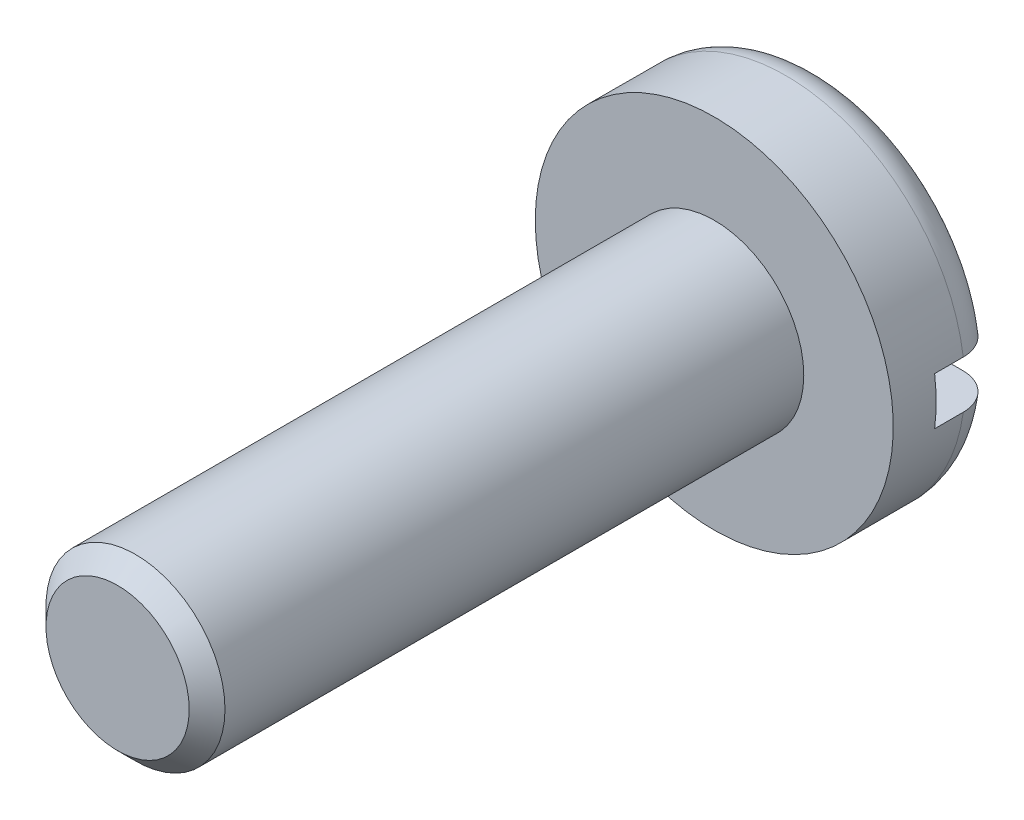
ISO-10303-21;
HEADER;
FILE_DESCRIPTION(('STEP AP214'),'2;1');
FILE_NAME('part.step','',(''),(''),'','','');
FILE_SCHEMA(('AUTOMOTIVE_DESIGN { 1 0 10303 214 1 1 1 1 }'));
ENDSEC;
DATA;
#1=APPLICATION_CONTEXT('core data for automotive mechanical design processes');
#2=APPLICATION_PROTOCOL_DEFINITION('international standard','automotive_design',2000,#1);
#3=PRODUCT_CONTEXT('',#1,'mechanical');
#4=PRODUCT('Part','Part','',(#3));
#5=PRODUCT_RELATED_PRODUCT_CATEGORY('part','',(#4));
#6=PRODUCT_DEFINITION_FORMATION('','',#4);
#7=PRODUCT_DEFINITION_CONTEXT('part definition',#1,'design');
#8=PRODUCT_DEFINITION('design','',#6,#7);
#9=PRODUCT_DEFINITION_SHAPE('','',#8);
#10=(LENGTH_UNIT() NAMED_UNIT(*) SI_UNIT(.MILLI.,.METRE.));
#11=(NAMED_UNIT(*) PLANE_ANGLE_UNIT() SI_UNIT($,.RADIAN.));
#12=(NAMED_UNIT(*) SI_UNIT($,.STERADIAN.) SOLID_ANGLE_UNIT());
#13=UNCERTAINTY_MEASURE_WITH_UNIT(LENGTH_MEASURE(1.E-05),#10,'distance_accuracy_value','');
#14=(GEOMETRIC_REPRESENTATION_CONTEXT(3) GLOBAL_UNCERTAINTY_ASSIGNED_CONTEXT((#13)) GLOBAL_UNIT_ASSIGNED_CONTEXT((#10,
#11,#12)) REPRESENTATION_CONTEXT('',''));
#15=CARTESIAN_POINT('',(0.,0.,0.));
#16=DIRECTION('',(0.,0.,1.));
#17=DIRECTION('',(1.,0.,0.));
#18=AXIS2_PLACEMENT_3D('',#15,#16,#17);
#19=CARTESIAN_POINT('',(0.,0.,-1.8));
#20=DIRECTION('',(0.,0.,1.));
#21=DIRECTION('',(1.,0.,0.));
#22=AXIS2_PLACEMENT_3D('',#19,#20,#21);
#23=PLANE('',#22);
#24=DIRECTION('',(1.,0.,0.));
#25=VECTOR('',#24,1.);
#26=CARTESIAN_POINT('',(-3.,-0.4,-1.8));
#27=LINE('',#26,#25);
#28=CARTESIAN_POINT('',(-2.36643191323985,-0.4,-1.8));
#29=VERTEX_POINT('',#28);
#30=CARTESIAN_POINT('',(2.36643191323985,-0.4,-1.8));
#31=VERTEX_POINT('',#30);
#32=EDGE_CURVE('E158',#29,#31,#27,.T.);
#33=ORIENTED_EDGE('',*,*,#32,.T.);
#34=CARTESIAN_POINT('',(0.,0.,-1.8));
#35=DIRECTION('',(0.,0.,-1.));
#36=DIRECTION('',(-1.,0.,0.));
#37=AXIS2_PLACEMENT_3D('',#34,#35,#36);
#38=CIRCLE('',#37,2.4);
#39=EDGE_CURVE('E110',#31,#29,#38,.T.);
#40=ORIENTED_EDGE('',*,*,#39,.T.);
#41=EDGE_LOOP('',(#33,#40));
#42=FACE_BOUND('',#41,.T.);
#43=ADVANCED_FACE('F29',(#42),#23,.F.);
#44=DIRECTION('',(-1.,0.,0.));
#45=VECTOR('',#44,1.);
#46=CARTESIAN_POINT('',(-3.,0.4,-1.8));
#47=LINE('',#46,#45);
#48=CARTESIAN_POINT('',(2.36643191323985,0.4,-1.8));
#49=VERTEX_POINT('',#48);
#50=CARTESIAN_POINT('',(-2.36643191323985,0.4,-1.8));
#51=VERTEX_POINT('',#50);
#52=EDGE_CURVE('E95',#49,#51,#47,.T.);
#53=ORIENTED_EDGE('',*,*,#52,.T.);
#54=EDGE_CURVE('E106',#51,#49,#38,.T.);
#55=ORIENTED_EDGE('',*,*,#54,.T.);
#56=EDGE_LOOP('',(#53,#55));
#57=FACE_BOUND('',#56,.T.);
#58=ADVANCED_FACE('F152',(#57),#23,.F.);
#59=CARTESIAN_POINT('',(0.,0.,-1.2));
#60=DIRECTION('',(0.,0.,-1.));
#61=DIRECTION('',(-1.,0.,0.));
#62=AXIS2_PLACEMENT_3D('',#59,#60,#61);
#63=TOROIDAL_SURFACE('',#62,2.4,0.6);
#64=CARTESIAN_POINT('',(-2.86791536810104,-0.4,-1.53809091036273));
#65=CARTESIAN_POINT('',(-2.88691562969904,-0.4,-1.51049908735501));
#66=CARTESIAN_POINT('',(-2.90360941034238,-0.4,-1.48129079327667));
#67=CARTESIAN_POINT('',(-2.93187395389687,-0.4,-1.42046435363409));
#68=CARTESIAN_POINT('',(-2.94343900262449,-0.4,-1.3888435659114));
#69=CARTESIAN_POINT('',(-2.9610841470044,-0.4,-1.32411273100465));
#70=CARTESIAN_POINT('',(-2.96716574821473,-0.4,-1.29100309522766));
#71=CARTESIAN_POINT('',(-2.973665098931,-0.4,-1.22424080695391));
#72=CARTESIAN_POINT('',(-2.97408418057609,-0.4,-1.19058828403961));
#73=CARTESIAN_POINT('',(-2.96925650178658,-0.4,-1.12377978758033));
#74=CARTESIAN_POINT('',(-2.96402436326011,-0.4,-1.09062275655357));
#75=CARTESIAN_POINT('',(-2.94807176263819,-0.4,-1.02565585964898));
#76=CARTESIAN_POINT('',(-2.93735113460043,-0.4,-0.993846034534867));
#77=CARTESIAN_POINT('',(-2.9107260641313,-0.4,-0.932444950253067));
#78=CARTESIAN_POINT('',(-2.89481734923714,-0.4,-0.902855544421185));
#79=CARTESIAN_POINT('',(-2.85828371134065,-0.4,-0.846748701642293));
#80=CARTESIAN_POINT('',(-2.83765870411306,-0.4,-0.820231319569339));
#81=CARTESIAN_POINT('',(-2.79216361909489,-0.4,-0.770859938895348));
#82=CARTESIAN_POINT('',(-2.76727091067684,-0.4,-0.748026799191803));
#83=CARTESIAN_POINT('',(-2.71403599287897,-0.4,-0.706818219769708));
#84=CARTESIAN_POINT('',(-2.68569364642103,-0.4,-0.68844295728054));
#85=CARTESIAN_POINT('',(-2.62608519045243,-0.4,-0.656485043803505));
#86=CARTESIAN_POINT('',(-2.59479436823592,-0.4,-0.642948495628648));
#87=CARTESIAN_POINT('',(-2.53040085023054,-0.4,-0.621255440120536));
#88=CARTESIAN_POINT('',(-2.49729804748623,-0.4,-0.613099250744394));
#89=CARTESIAN_POINT('',(-2.4298233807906,-0.4,-0.602302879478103));
#90=CARTESIAN_POINT('',(-2.39544144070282,-0.4,-0.599725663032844));
#91=CARTESIAN_POINT('',(-2.32672713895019,-0.4,-0.600320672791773));
#92=CARTESIAN_POINT('',(-2.29239478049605,-0.4,-0.603493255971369));
#93=CARTESIAN_POINT('',(-2.22440412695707,-0.4,-0.615543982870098));
#94=CARTESIAN_POINT('',(-2.19075551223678,-0.4,-0.624476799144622));
#95=CARTESIAN_POINT('',(-2.12542650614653,-0.4,-0.64784847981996));
#96=CARTESIAN_POINT('',(-2.09374619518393,-0.4,-0.662287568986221));
#97=CARTESIAN_POINT('',(-2.03317876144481,-0.4,-0.696326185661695));
#98=CARTESIAN_POINT('',(-2.00429919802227,-0.4,-0.715939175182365));
#99=CARTESIAN_POINT('',(-1.95028138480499,-0.4,-0.759778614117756));
#100=CARTESIAN_POINT('',(-1.92514302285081,-0.4,-0.784004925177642));
#101=CARTESIAN_POINT('',(-1.879604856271,-0.4,-0.836153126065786));
#102=CARTESIAN_POINT('',(-1.85916168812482,-0.4,-0.864037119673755));
#103=CARTESIAN_POINT('',(-1.82336424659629,-0.4,-0.922900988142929));
#104=CARTESIAN_POINT('',(-1.80800931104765,-0.4,-0.953880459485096));
#105=CARTESIAN_POINT('',(-1.783172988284,-0.4,-1.01736374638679));
#106=CARTESIAN_POINT('',(-1.77357543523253,-0.4,-1.04982210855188));
#107=CARTESIAN_POINT('',(-1.76008936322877,-0.4,-1.11590300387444));
#108=CARTESIAN_POINT('',(-1.75620005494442,-0.4,-1.14952537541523));
#109=CARTESIAN_POINT('',(-1.75428554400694,-0.4,-1.21627187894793));
#110=CARTESIAN_POINT('',(-1.75614646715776,-0.4,-1.24939279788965));
#111=CARTESIAN_POINT('',(-1.76542044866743,-0.4,-1.31484631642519));
#112=CARTESIAN_POINT('',(-1.77283334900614,-0.4,-1.34717893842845));
#113=CARTESIAN_POINT('',(-1.79293509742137,-0.4,-1.41006202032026));
#114=CARTESIAN_POINT('',(-1.80560987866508,-0.4,-1.4406169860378));
#115=CARTESIAN_POINT('',(-1.83582889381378,-0.4,-1.49921405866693));
#116=CARTESIAN_POINT('',(-1.85337349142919,-0.4,-1.52725597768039));
#117=CARTESIAN_POINT('',(-1.8931254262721,-0.4,-1.58053047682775));
#118=CARTESIAN_POINT('',(-1.91540419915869,-0.4,-1.6057097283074));
#119=CARTESIAN_POINT('',(-1.96379049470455,-0.4,-1.6520716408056));
#120=CARTESIAN_POINT('',(-1.98989845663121,-0.4,-1.67325384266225));
#121=CARTESIAN_POINT('',(-2.04582323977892,-0.4,-1.71150342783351));
#122=CARTESIAN_POINT('',(-2.07570903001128,-0.4,-1.72847001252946));
#123=CARTESIAN_POINT('',(-2.13787630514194,-0.4,-1.75722500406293));
#124=CARTESIAN_POINT('',(-2.17015799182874,-0.4,-1.76901297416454));
#125=CARTESIAN_POINT('',(-2.23668253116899,-0.4,-1.78721942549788));
#126=CARTESIAN_POINT('',(-2.27094628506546,-0.4,-1.79356164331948));
#127=CARTESIAN_POINT('',(-2.34005178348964,-0.4,-1.80041149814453));
#128=CARTESIAN_POINT('',(-2.37489351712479,-0.4,-1.80091924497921));
#129=CARTESIAN_POINT('',(-2.4442018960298,-0.4,-1.79606324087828));
#130=CARTESIAN_POINT('',(-2.47866813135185,-0.4,-1.79069361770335));
#131=CARTESIAN_POINT('',(-2.54620434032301,-0.4,-1.77419498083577));
#132=CARTESIAN_POINT('',(-2.57927401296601,-0.4,-1.76306473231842));
#133=CARTESIAN_POINT('',(-2.64279515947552,-0.4,-1.73544271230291));
#134=CARTESIAN_POINT('',(-2.67326439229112,-0.4,-1.71899173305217));
#135=CARTESIAN_POINT('',(-2.73093679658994,-0.4,-1.68116176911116));
#136=CARTESIAN_POINT('',(-2.75814405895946,-0.4,-1.65978905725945));
#137=CARTESIAN_POINT('',(-2.79912965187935,-0.4,-1.62148942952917));
#138=CARTESIAN_POINT('',(-2.81414187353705,-0.4,-1.60586063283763));
#139=CARTESIAN_POINT('',(-2.84239557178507,-0.4,-1.57307653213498));
#140=CARTESIAN_POINT('',(-2.85563706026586,-0.4,-1.5559212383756));
#141=CARTESIAN_POINT('',(-2.86791536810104,-0.4,-1.53809091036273));
#142=B_SPLINE_CURVE_WITH_KNOTS('',3,(#64,#65,#66,#67,#68,#69,#70,#71,#72,#73,#74,#75,#76,#77,
#78,#79,#80,#81,#82,#83,#84,#85,#86,#87,#88,#89,#90,#91,#92,#93,#94,#95,#96,#97,#98,#99,#100,
#101,#102,#103,#104,#105,#106,#107,#108,#109,#110,#111,#112,#113,#114,#115,#116,#117,#118,#119,
#120,#121,#122,#123,#124,#125,#126,#127,#128,#129,#130,#131,#132,#133,#134,#135,#136,#137,#138,
#139,#140,#141),.UNSPECIFIED.,.T.,.F.,(4,2,2,2,2,2,2,2,2,2,2,2,2,2,2,2,2,2,2,2,2,2,2,2,2,2,2,2,
2,2,2,2,2,2,2,2,2,2,4),(0.,0.100424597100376,0.200960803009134,0.301469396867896,
0.401954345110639,0.502179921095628,0.602408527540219,0.702719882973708,0.803033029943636,
0.903895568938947,1.00476211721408,1.10656558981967,1.20837507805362,1.31132774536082,
1.4142868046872,1.51823776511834,1.6221929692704,1.72642136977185,1.83064664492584,
1.933866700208,2.03707331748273,2.13812063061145,2.23915396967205,2.33819941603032,
2.43724204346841,2.53602158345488,2.63480850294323,2.73520792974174,2.8356188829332,
2.93823928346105,3.04086833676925,3.14491222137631,3.24895414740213,3.3531001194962,
3.45726842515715,3.56065632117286,3.66391316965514,3.72880977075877,3.79370593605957),.UNSPECIFIED.);
#143=CARTESIAN_POINT('',(-2.9732137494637,-0.4,-1.2));
#144=VERTEX_POINT('',#143);
#145=EDGE_CURVE('E50',#29,#144,#142,.T.);
#146=ORIENTED_EDGE('',*,*,#145,.F.);
#147=ORIENTED_EDGE('',*,*,#39,.F.);
#148=CARTESIAN_POINT('',(1.80821051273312,-0.4,-1.44415878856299));
#149=CARTESIAN_POINT('',(1.79450723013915,-0.4,-1.41412104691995));
#150=CARTESIAN_POINT('',(1.783303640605,-0.4,-1.38291945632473));
#151=CARTESIAN_POINT('',(1.7662786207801,-0.4,-1.31905688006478));
#152=CARTESIAN_POINT('',(1.76046230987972,-0.4,-1.28639453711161));
#153=CARTESIAN_POINT('',(1.75442120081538,-0.4,-1.22055541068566));
#154=CARTESIAN_POINT('',(1.75419603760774,-0.4,-1.1873786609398));
#155=CARTESIAN_POINT('',(1.75934539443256,-0.4,-1.12147069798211));
#156=CARTESIAN_POINT('',(1.76471879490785,-0.4,-1.08873939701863));
#157=CARTESIAN_POINT('',(1.78084975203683,-0.4,-1.02476479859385));
#158=CARTESIAN_POINT('',(1.79158706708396,-0.4,-0.993516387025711));
#159=CARTESIAN_POINT('',(1.81808721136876,-0.4,-0.933229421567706));
#160=CARTESIAN_POINT('',(1.83385049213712,-0.4,-0.904191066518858));
#161=CARTESIAN_POINT('',(1.87016113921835,-0.4,-0.848717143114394));
#162=CARTESIAN_POINT('',(1.89077014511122,-0.4,-0.822321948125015));
#163=CARTESIAN_POINT('',(1.93603826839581,-0.4,-0.773270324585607));
#164=CARTESIAN_POINT('',(1.96069783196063,-0.4,-0.750614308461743));
#165=CARTESIAN_POINT('',(2.0139571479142,-0.4,-0.709156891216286));
#166=CARTESIAN_POINT('',(2.04263221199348,-0.4,-0.690452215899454));
#167=CARTESIAN_POINT('',(2.10267683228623,-0.4,-0.658032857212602));
#168=CARTESIAN_POINT('',(2.13404663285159,-0.4,-0.644318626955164));
#169=CARTESIAN_POINT('',(2.19913303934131,-0.4,-0.622064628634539));
#170=CARTESIAN_POINT('',(2.23287910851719,-0.4,-0.613610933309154));
#171=CARTESIAN_POINT('',(2.30131074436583,-0.4,-0.602466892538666));
#172=CARTESIAN_POINT('',(2.33599634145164,-0.4,-0.599776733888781));
#173=CARTESIAN_POINT('',(2.40544538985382,-0.4,-0.600253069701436));
#174=CARTESIAN_POINT('',(2.44020871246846,-0.4,-0.603439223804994));
#175=CARTESIAN_POINT('',(2.50869729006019,-0.4,-0.615642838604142));
#176=CARTESIAN_POINT('',(2.54242257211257,-0.4,-0.624660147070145));
#177=CARTESIAN_POINT('',(2.60763064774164,-0.4,-0.648217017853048));
#178=CARTESIAN_POINT('',(2.63912698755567,-0.4,-0.662719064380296));
#179=CARTESIAN_POINT('',(2.69919951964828,-0.4,-0.696862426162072));
#180=CARTESIAN_POINT('',(2.72777587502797,-0.4,-0.716503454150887));
#181=CARTESIAN_POINT('',(2.78085904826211,-0.4,-0.760134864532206));
#182=CARTESIAN_POINT('',(2.80540738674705,-0.4,-0.784074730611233));
#183=CARTESIAN_POINT('',(2.85008327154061,-0.4,-0.835775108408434));
#184=CARTESIAN_POINT('',(2.8702110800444,-0.4,-0.863535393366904));
#185=CARTESIAN_POINT('',(2.90525154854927,-0.4,-0.921768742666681));
#186=CARTESIAN_POINT('',(2.92021748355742,-0.4,-0.952209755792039));
#187=CARTESIAN_POINT('',(2.94478217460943,-0.4,-1.01518535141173));
#188=CARTESIAN_POINT('',(2.95438117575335,-0.4,-1.04771983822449));
#189=CARTESIAN_POINT('',(2.9678730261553,-0.4,-1.1136969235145));
#190=CARTESIAN_POINT('',(2.97180801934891,-0.4,-1.14713090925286));
#191=CARTESIAN_POINT('',(2.97399012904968,-0.4,-1.21418363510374));
#192=CARTESIAN_POINT('',(2.97223738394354,-0.4,-1.2478023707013));
#193=CARTESIAN_POINT('',(2.96311046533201,-0.4,-1.31416285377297));
#194=CARTESIAN_POINT('',(2.95575341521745,-0.4,-1.3469069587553));
#195=CARTESIAN_POINT('',(2.93565569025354,-0.4,-1.41069837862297));
#196=CARTESIAN_POINT('',(2.92291501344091,-0.4,-1.44174569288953));
#197=CARTESIAN_POINT('',(2.89239690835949,-0.4,-1.50132550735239));
#198=CARTESIAN_POINT('',(2.87461067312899,-0.4,-1.52985349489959));
#199=CARTESIAN_POINT('',(2.83452923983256,-0.4,-1.58354220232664));
#200=CARTESIAN_POINT('',(2.81223393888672,-0.4,-1.6087028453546));
#201=CARTESIAN_POINT('',(2.76362299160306,-0.4,-1.65511787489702));
#202=CARTESIAN_POINT('',(2.73728293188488,-0.4,-1.67634668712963));
#203=CARTESIAN_POINT('',(2.68144180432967,-0.4,-1.71413135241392));
#204=CARTESIAN_POINT('',(2.65194058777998,-0.4,-1.73068698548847));
#205=CARTESIAN_POINT('',(2.59030619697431,-0.4,-1.75883285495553));
#206=CARTESIAN_POINT('',(2.55814997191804,-0.4,-1.77037260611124));
#207=CARTESIAN_POINT('',(2.4923689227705,-0.4,-1.78795653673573));
#208=CARTESIAN_POINT('',(2.45874400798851,-0.4,-1.79400037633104));
#209=CARTESIAN_POINT('',(2.39057532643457,-0.4,-1.80048954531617));
#210=CARTESIAN_POINT('',(2.35602547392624,-0.4,-1.80087097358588));
#211=CARTESIAN_POINT('',(2.2873444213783,-0.4,-1.7958819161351));
#212=CARTESIAN_POINT('',(2.25321323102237,-0.4,-1.79051129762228));
#213=CARTESIAN_POINT('',(2.18602611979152,-0.4,-1.774105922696));
#214=CARTESIAN_POINT('',(2.15298206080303,-0.4,-1.76302254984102));
#215=CARTESIAN_POINT('',(2.08921057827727,-0.4,-1.73546663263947));
#216=CARTESIAN_POINT('',(2.05848379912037,-0.4,-1.71899259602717));
#217=CARTESIAN_POINT('',(2.00021398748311,-0.4,-1.68108334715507));
#218=CARTESIAN_POINT('',(1.97267445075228,-0.4,-1.65964276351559));
#219=CARTESIAN_POINT('',(1.9216665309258,-0.4,-1.61240514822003));
#220=CARTESIAN_POINT('',(1.89819309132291,-0.4,-1.58661360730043));
#221=CARTESIAN_POINT('',(1.86353882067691,-0.4,-1.54123382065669));
#222=CARTESIAN_POINT('',(1.85095456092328,-0.4,-1.52269988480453));
#223=CARTESIAN_POINT('',(1.82793428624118,-0.4,-1.48434176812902));
#224=CARTESIAN_POINT('',(1.81749824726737,-0.4,-1.46451760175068));
#225=CARTESIAN_POINT('',(1.80821051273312,-0.4,-1.44415878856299));
#226=B_SPLINE_CURVE_WITH_KNOTS('',3,(#148,#149,#150,#151,#152,#153,#154,#155,#156,#157,#158,
#159,#160,#161,#162,#163,#164,#165,#166,#167,#168,#169,#170,#171,#172,#173,#174,#175,#176,#177,
#178,#179,#180,#181,#182,#183,#184,#185,#186,#187,#188,#189,#190,#191,#192,#193,#194,#195,#196,
#197,#198,#199,#200,#201,#202,#203,#204,#205,#206,#207,#208,#209,#210,#211,#212,#213,#214,#215,
#216,#217,#218,#219,#220,#221,#222,#223,#224,#225),.UNSPECIFIED.,.T.,.F.,(4,2,2,2,2,2,2,2,2,2,2,
2,2,2,2,2,2,2,2,2,2,2,2,2,2,2,2,2,2,2,2,2,2,2,2,2,2,2,4),(0.,0.0989673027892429,
0.198028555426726,0.297083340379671,0.396118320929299,0.494782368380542,0.593455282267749,
0.693458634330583,0.793473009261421,0.895707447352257,0.997951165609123,1.10182660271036,
1.20570540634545,1.30993237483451,1.41415662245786,1.51768050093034,1.6211985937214,
1.72357156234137,1.82593845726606,1.92721478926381,2.02848649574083,2.12900070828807,
2.22951247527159,2.32971836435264,2.42992428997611,2.53030621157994,2.63069042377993,
2.73170625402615,2.83272683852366,2.93474189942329,3.03676326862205,3.13993509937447,
3.2431093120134,3.34717641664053,3.45127235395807,3.55548140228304,3.65955991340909,
3.72663817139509,3.79371567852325),.UNSPECIFIED.);
#227=CARTESIAN_POINT('',(2.9732137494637,-0.4,-1.2));
#228=VERTEX_POINT('',#227);
#229=EDGE_CURVE('E122',#228,#31,#226,.T.);
#230=ORIENTED_EDGE('',*,*,#229,.F.);
#231=CARTESIAN_POINT('',(0.,0.,-1.2));
#232=DIRECTION('',(0.,0.,-1.));
#233=DIRECTION('',(-1.,0.,0.));
#234=AXIS2_PLACEMENT_3D('',#231,#232,#233);
#235=CIRCLE('',#234,3.);
#236=EDGE_CURVE('E117',#228,#144,#235,.T.);
#237=ORIENTED_EDGE('',*,*,#236,.T.);
#238=EDGE_LOOP('',(#146,#147,#230,#237));
#239=FACE_BOUND('',#238,.T.);
#240=ADVANCED_FACE('F130',(#239),#63,.T.);
#241=CARTESIAN_POINT('',(-2.86791536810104,0.4,-1.53809091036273));
#242=CARTESIAN_POINT('',(-2.84868400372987,0.4,-1.56601293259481));
#243=CARTESIAN_POINT('',(-2.82706189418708,0.4,-1.59232017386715));
#244=CARTESIAN_POINT('',(-2.77967761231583,0.4,-1.64094009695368));
#245=CARTESIAN_POINT('',(-2.75391006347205,0.4,-1.66324751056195));
#246=CARTESIAN_POINT('',(-2.6990251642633,0.4,-1.70321130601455));
#247=CARTESIAN_POINT('',(-2.66991093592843,0.4,-1.72087197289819));
#248=CARTESIAN_POINT('',(-2.60915830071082,0.4,-1.7510936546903));
#249=CARTESIAN_POINT('',(-2.57752051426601,0.4,-1.76365591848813));
#250=CARTESIAN_POINT('',(-2.51233990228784,0.4,-1.78344987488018));
#251=CARTESIAN_POINT('',(-2.47878374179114,0.4,-1.79063764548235));
#252=CARTESIAN_POINT('',(-2.41094258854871,0.4,-1.79934399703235));
#253=CARTESIAN_POINT('',(-2.37665752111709,0.4,-1.80086199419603));
#254=CARTESIAN_POINT('',(-2.30793726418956,0.4,-1.79819413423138));
#255=CARTESIAN_POINT('',(-2.27350447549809,0.4,-1.7939462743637));
#256=CARTESIAN_POINT('',(-2.20582843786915,0.4,-1.77976818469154));
#257=CARTESIAN_POINT('',(-2.17258525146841,0.4,-1.76983765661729));
#258=CARTESIAN_POINT('',(-2.10802002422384,0.4,-1.7444896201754));
#259=CARTESIAN_POINT('',(-2.07671123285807,0.4,-1.7290383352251));
#260=CARTESIAN_POINT('',(-2.01714433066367,0.4,-1.6930784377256));
#261=CARTESIAN_POINT('',(-1.98888623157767,0.4,-1.67256980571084));
#262=CARTESIAN_POINT('',(-1.93637236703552,0.4,-1.62714599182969));
#263=CARTESIAN_POINT('',(-1.91210023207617,0.4,-1.6022497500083));
#264=CARTESIAN_POINT('',(-1.86816721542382,0.4,-1.5486737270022));
#265=CARTESIAN_POINT('',(-1.84850591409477,0.4,-1.51999429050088));
#266=CARTESIAN_POINT('',(-1.8147314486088,0.4,-1.46018356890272));
#267=CARTESIAN_POINT('',(-1.80052886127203,0.4,-1.42910280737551));
#268=CARTESIAN_POINT('',(-1.77767972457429,0.4,-1.36496231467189));
#269=CARTESIAN_POINT('',(-1.76903232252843,0.4,-1.33190288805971));
#270=CARTESIAN_POINT('',(-1.75772456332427,0.4,-1.26553575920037));
#271=CARTESIAN_POINT('',(-1.75493497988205,0.4,-1.23225003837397));
#272=CARTESIAN_POINT('',(-1.75505258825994,0.4,-1.16569015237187));
#273=CARTESIAN_POINT('',(-1.75795932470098,0.4,-1.13241598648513));
#274=CARTESIAN_POINT('',(-1.76930492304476,0.4,-1.06720273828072));
#275=CARTESIAN_POINT('',(-1.77768298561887,0.4,-1.03525304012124));
#276=CARTESIAN_POINT('',(-1.79963421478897,0.4,-0.97319290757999));
#277=CARTESIAN_POINT('',(-1.81320758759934,0.4,-0.943082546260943));
#278=CARTESIAN_POINT('',(-1.84527443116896,0.4,-0.885231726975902));
#279=CARTESIAN_POINT('',(-1.86381370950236,0.4,-0.857516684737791));
#280=CARTESIAN_POINT('',(-1.90518919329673,0.4,-0.805506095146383));
#281=CARTESIAN_POINT('',(-1.92802585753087,0.4,-0.781210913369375));
#282=CARTESIAN_POINT('',(-1.97787851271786,0.4,-0.73617072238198));
#283=CARTESIAN_POINT('',(-2.0049744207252,0.4,-0.715514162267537));
#284=CARTESIAN_POINT('',(-2.06219809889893,0.4,-0.678945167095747));
#285=CARTESIAN_POINT('',(-2.09232617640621,0.4,-0.663033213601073));
#286=CARTESIAN_POINT('',(-2.15535638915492,0.4,-0.636120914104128));
#287=CARTESIAN_POINT('',(-2.18829916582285,0.4,-0.625215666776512));
#288=CARTESIAN_POINT('',(-2.25554284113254,0.4,-0.609051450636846));
#289=CARTESIAN_POINT('',(-2.28984380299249,0.4,-0.603792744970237));
#290=CARTESIAN_POINT('',(-2.3590569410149,0.4,-0.599065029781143));
#291=CARTESIAN_POINT('',(-2.39397158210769,0.4,-0.599631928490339));
#292=CARTESIAN_POINT('',(-2.46320550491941,0.4,-0.606649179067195));
#293=CARTESIAN_POINT('',(-2.49752479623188,0.4,-0.613099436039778));
#294=CARTESIAN_POINT('',(-2.56440715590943,0.4,-0.631681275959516));
#295=CARTESIAN_POINT('',(-2.59697808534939,0.4,-0.643784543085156));
#296=CARTESIAN_POINT('',(-2.65959335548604,0.4,-0.673344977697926));
#297=CARTESIAN_POINT('',(-2.68963782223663,0.4,-0.690801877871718));
#298=CARTESIAN_POINT('',(-2.7460058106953,0.4,-0.730378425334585));
#299=CARTESIAN_POINT('',(-2.77236533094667,0.4,-0.752446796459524));
#300=CARTESIAN_POINT('',(-2.82095331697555,0.4,-0.800740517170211));
#301=CARTESIAN_POINT('',(-2.8431820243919,0.4,-0.826965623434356));
#302=CARTESIAN_POINT('',(-2.88262005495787,0.4,-0.882515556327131));
#303=CARTESIAN_POINT('',(-2.89988204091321,0.4,-0.9118029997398));
#304=CARTESIAN_POINT('',(-2.92919534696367,0.4,-0.972877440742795));
#305=CARTESIAN_POINT('',(-2.94124713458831,0.4,-1.00466421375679));
#306=CARTESIAN_POINT('',(-2.95970040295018,0.4,-1.06954657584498));
#307=CARTESIAN_POINT('',(-2.96614872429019,0.4,-1.10262885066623));
#308=CARTESIAN_POINT('',(-2.97337569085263,0.4,-1.1694160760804));
#309=CARTESIAN_POINT('',(-2.97415305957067,0.4,-1.20312116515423));
#310=CARTESIAN_POINT('',(-2.97002108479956,0.4,-1.27005512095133));
#311=CARTESIAN_POINT('',(-2.96513219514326,0.4,-1.30328526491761));
#312=CARTESIAN_POINT('',(-2.9498475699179,0.4,-1.36842386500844));
#313=CARTESIAN_POINT('',(-2.93945864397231,0.4,-1.40033390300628));
#314=CARTESIAN_POINT('',(-2.91857987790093,0.4,-1.44989721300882));
#315=CARTESIAN_POINT('',(-2.9097136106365,0.4,-1.46825183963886));
#316=CARTESIAN_POINT('',(-2.89015758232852,0.4,-1.50396217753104));
#317=CARTESIAN_POINT('',(-2.8794678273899,0.4,-1.52131789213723));
#318=CARTESIAN_POINT('',(-2.86791536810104,0.4,-1.53809091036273));
#319=B_SPLINE_CURVE_WITH_KNOTS('',3,(#241,#242,#243,#244,#245,#246,#247,#248,#249,#250,#251,
#252,#253,#254,#255,#256,#257,#258,#259,#260,#261,#262,#263,#264,#265,#266,#267,#268,#269,#270,
#271,#272,#273,#274,#275,#276,#277,#278,#279,#280,#281,#282,#283,#284,#285,#286,#287,#288,#289,
#290,#291,#292,#293,#294,#295,#296,#297,#298,#299,#300,#301,#302,#303,#304,#305,#306,#307,#308,
#309,#310,#311,#312,#313,#314,#315,#316,#317,#318),.UNSPECIFIED.,.T.,.F.,(4,2,2,2,2,2,2,2,2,2,2,
2,2,2,2,2,2,2,2,2,2,2,2,2,2,2,2,2,2,2,2,2,2,2,2,2,2,2,4),(0.,0.101636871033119,
0.203406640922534,0.305082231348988,0.40673290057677,0.509205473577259,0.611688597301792,
0.715282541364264,0.818881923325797,0.923126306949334,1.02737109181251,1.13117643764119,
1.23497233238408,1.3369869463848,1.43898589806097,1.53870999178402,1.63842611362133,
1.73705258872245,1.83568297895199,1.93525652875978,2.03484071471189,2.13658522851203,
2.23834006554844,2.34195493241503,2.44557462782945,2.54983340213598,2.65409049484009,
2.75783087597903,2.86156607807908,2.96420396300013,3.06683584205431,3.16833561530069,
3.26982627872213,3.37046016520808,3.47111670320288,3.57141102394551,3.67158145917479,
3.73263587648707,3.79369008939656),.UNSPECIFIED.);
#320=CARTESIAN_POINT('',(-2.9732137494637,0.4,-1.2));
#321=VERTEX_POINT('',#320);
#322=EDGE_CURVE('E163',#321,#51,#319,.T.);
#323=ORIENTED_EDGE('',*,*,#322,.F.);
#324=CARTESIAN_POINT('',(2.9732137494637,0.4,-1.2));
#325=VERTEX_POINT('',#324);
#326=EDGE_CURVE('E115',#321,#325,#235,.T.);
#327=ORIENTED_EDGE('',*,*,#326,.T.);
#328=CARTESIAN_POINT('',(1.80821051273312,0.4,-1.44415878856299));
#329=CARTESIAN_POINT('',(1.82231047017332,0.4,-1.47505857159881));
#330=CARTESIAN_POINT('',(1.83907724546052,0.4,-1.50477209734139));
#331=CARTESIAN_POINT('',(1.87740165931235,0.4,-1.56096909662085));
#332=CARTESIAN_POINT('',(1.89896631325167,0.4,-1.5874477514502));
#333=CARTESIAN_POINT('',(1.94618177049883,0.4,-1.63639884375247));
#334=CARTESIAN_POINT('',(1.97182686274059,0.4,-1.65887678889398));
#335=CARTESIAN_POINT('',(2.02646954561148,0.4,-1.69927713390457));
#336=CARTESIAN_POINT('',(2.05546627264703,0.4,-1.7172007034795));
#337=CARTESIAN_POINT('',(2.11645988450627,0.4,-1.7482694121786));
#338=CARTESIAN_POINT('',(2.14849486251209,0.4,-1.76133979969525));
#339=CARTESIAN_POINT('',(2.21429462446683,0.4,-1.78197209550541));
#340=CARTESIAN_POINT('',(2.24805958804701,0.4,-1.78953343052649));
#341=CARTESIAN_POINT('',(2.31668083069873,0.4,-1.79897312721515));
#342=CARTESIAN_POINT('',(2.35154411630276,0.4,-1.8008006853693));
#343=CARTESIAN_POINT('',(2.4210815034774,0.4,-1.79855854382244));
#344=CARTESIAN_POINT('',(2.45575560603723,0.4,-1.79448887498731));
#345=CARTESIAN_POINT('',(2.52381156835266,0.4,-1.78056283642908));
#346=CARTESIAN_POINT('',(2.557197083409,0.4,-1.77072435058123));
#347=CARTESIAN_POINT('',(2.62181601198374,0.4,-1.74552630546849));
#348=CARTESIAN_POINT('',(2.65304953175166,0.4,-1.7301670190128));
#349=CARTESIAN_POINT('',(2.7121444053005,0.4,-1.69452205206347));
#350=CARTESIAN_POINT('',(2.74003609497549,0.4,-1.67428667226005));
#351=CARTESIAN_POINT('',(2.79197658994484,0.4,-1.62937109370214));
#352=CARTESIAN_POINT('',(2.81602562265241,0.4,-1.60469115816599));
#353=CARTESIAN_POINT('',(2.85931177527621,0.4,-1.55188767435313));
#354=CARTESIAN_POINT('',(2.87860010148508,0.4,-1.5238060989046));
#355=CARTESIAN_POINT('',(2.91213782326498,0.4,-1.46477974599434));
#356=CARTESIAN_POINT('',(2.92638748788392,0.4,-1.43383512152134));
#357=CARTESIAN_POINT('',(2.94931443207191,0.4,-1.37026360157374));
#358=CARTESIAN_POINT('',(2.95804100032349,0.4,-1.33765447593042));
#359=CARTESIAN_POINT('',(2.9698648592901,0.4,-1.27143133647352));
#360=CARTESIAN_POINT('',(2.97296233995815,0.4,-1.23781735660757));
#361=CARTESIAN_POINT('',(2.97343453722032,0.4,-1.17071861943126));
#362=CARTESIAN_POINT('',(2.97083788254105,0.4,-1.1372340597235));
#363=CARTESIAN_POINT('',(2.96005758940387,0.4,-1.07117725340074));
#364=CARTESIAN_POINT('',(2.95187400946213,0.4,-1.0386049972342));
#365=CARTESIAN_POINT('',(2.93016485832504,0.4,-0.975303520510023));
#366=CARTESIAN_POINT('',(2.91664082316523,0.4,-0.944573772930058));
#367=CARTESIAN_POINT('',(2.88464744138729,0.4,-0.885807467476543));
#368=CARTESIAN_POINT('',(2.86617802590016,0.4,-0.857770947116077));
#369=CARTESIAN_POINT('',(2.82473788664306,0.4,-0.80504812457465));
#370=CARTESIAN_POINT('',(2.80174756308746,0.4,-0.780377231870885));
#371=CARTESIAN_POINT('',(2.75198245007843,0.4,-0.735206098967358));
#372=CARTESIAN_POINT('',(2.7252075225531,0.4,-0.714706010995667));
#373=CARTESIAN_POINT('',(2.66839302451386,0.4,-0.678266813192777));
#374=CARTESIAN_POINT('',(2.638327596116,0.4,-0.662368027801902));
#375=CARTESIAN_POINT('',(2.57597556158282,0.4,-0.635781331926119));
#376=CARTESIAN_POINT('',(2.54368883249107,0.4,-0.625093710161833));
#377=CARTESIAN_POINT('',(2.47743101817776,0.4,-0.609107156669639));
#378=CARTESIAN_POINT('',(2.44344529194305,0.4,-0.603868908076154));
#379=CARTESIAN_POINT('',(2.37507589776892,0.4,-0.599108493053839));
#380=CARTESIAN_POINT('',(2.34069220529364,0.4,-0.599586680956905));
#381=CARTESIAN_POINT('',(2.27212156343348,0.4,-0.606261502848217));
#382=CARTESIAN_POINT('',(2.23794040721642,0.4,-0.612517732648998));
#383=CARTESIAN_POINT('',(2.17110155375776,0.4,-0.630650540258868));
#384=CARTESIAN_POINT('',(2.13844393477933,0.4,-0.642527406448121));
#385=CARTESIAN_POINT('',(2.07542270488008,0.4,-0.671647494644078));
#386=CARTESIAN_POINT('',(2.04507089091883,0.4,-0.688916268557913));
#387=CARTESIAN_POINT('',(1.987719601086,0.4,-0.728335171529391));
#388=CARTESIAN_POINT('',(1.96072010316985,0.4,-0.750485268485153));
#389=CARTESIAN_POINT('',(1.91105063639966,0.4,-0.798907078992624));
#390=CARTESIAN_POINT('',(1.88835375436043,0.4,-0.825151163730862));
#391=CARTESIAN_POINT('',(1.84779009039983,0.4,-0.881138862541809));
#392=CARTESIAN_POINT('',(1.82992258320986,0.4,-0.910881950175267));
#393=CARTESIAN_POINT('',(1.79990105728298,0.4,-0.972422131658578));
#394=CARTESIAN_POINT('',(1.78764449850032,0.4,-1.0041691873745));
#395=CARTESIAN_POINT('',(1.76876607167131,0.4,-1.06930591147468));
#396=CARTESIAN_POINT('',(1.76214482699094,0.4,-1.10269576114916));
#397=CARTESIAN_POINT('',(1.75485143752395,0.4,-1.16940159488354));
#398=CARTESIAN_POINT('',(1.7540568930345,0.4,-1.20270431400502));
#399=CARTESIAN_POINT('',(1.75812388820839,0.4,-1.2689325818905));
#400=CARTESIAN_POINT('',(1.76297799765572,0.4,-1.30185856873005));
#401=CARTESIAN_POINT('',(1.77500398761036,0.4,-1.35302191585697));
#402=CARTESIAN_POINT('',(1.78038529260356,0.4,-1.37169888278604));
#403=CARTESIAN_POINT('',(1.79295726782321,0.4,-1.40843277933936));
#404=CARTESIAN_POINT('',(1.80014789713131,0.4,-1.42648972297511));
#405=CARTESIAN_POINT('',(1.80821051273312,0.4,-1.44415878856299));
#406=B_SPLINE_CURVE_WITH_KNOTS('',3,(#328,#329,#330,#331,#332,#333,#334,#335,#336,#337,#338,
#339,#340,#341,#342,#343,#344,#345,#346,#347,#348,#349,#350,#351,#352,#353,#354,#355,#356,#357,
#358,#359,#360,#361,#362,#363,#364,#365,#366,#367,#368,#369,#370,#371,#372,#373,#374,#375,#376,
#377,#378,#379,#380,#381,#382,#383,#384,#385,#386,#387,#388,#389,#390,#391,#392,#393,#394,#395,
#396,#397,#398,#399,#400,#401,#402,#403,#404,#405),.UNSPECIFIED.,.T.,.F.,(4,2,2,2,2,2,2,2,2,2,2,
2,2,2,2,2,2,2,2,2,2,2,2,2,2,2,2,2,2,2,2,2,2,2,2,2,2,2,4),(0.,0.101821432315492,
0.203792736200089,0.305622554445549,0.407426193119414,0.510738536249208,0.61406162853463,
0.718297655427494,0.822533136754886,0.926447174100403,1.03035607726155,1.13323580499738,
1.23610944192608,1.33782295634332,1.43953103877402,1.54031817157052,1.64110190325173,
1.74138008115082,1.84165720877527,1.94190551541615,2.04215521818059,2.14284952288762,
2.24354750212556,2.34510295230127,2.44666402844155,2.54934434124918,2.65203101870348,
2.75578879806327,2.8595519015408,2.96381439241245,3.06807619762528,3.17166260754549,
3.27523345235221,3.37682752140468,3.47843282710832,3.57789745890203,3.67723140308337,
3.73545609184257,3.7936794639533),.UNSPECIFIED.);
#407=EDGE_CURVE('E164',#49,#325,#406,.T.);
#408=ORIENTED_EDGE('',*,*,#407,.F.);
#409=ORIENTED_EDGE('',*,*,#54,.F.);
#410=EDGE_LOOP('',(#323,#327,#408,#409));
#411=FACE_BOUND('',#410,.T.);
#412=ADVANCED_FACE('F145',(#411),#63,.T.);
#413=CARTESIAN_POINT('',(0.,0.,0.));
#414=DIRECTION('',(0.,0.,-1.));
#415=DIRECTION('',(-1.,0.,0.));
#416=AXIS2_PLACEMENT_3D('',#413,#414,#415);
#417=CYLINDRICAL_SURFACE('',#416,3.);
#418=CARTESIAN_POINT('',(0.,0.,0.));
#419=DIRECTION('',(0.,0.,-1.));
#420=DIRECTION('',(-1.,0.,0.));
#421=AXIS2_PLACEMENT_3D('',#418,#419,#420);
#422=CIRCLE('',#421,3.);
#423=CARTESIAN_POINT('',(-3.,0.,0.));
#424=VERTEX_POINT('',#423);
#425=EDGE_CURVE('E119',#424,#424,#422,.T.);
#426=ORIENTED_EDGE('',*,*,#425,.T.);
#427=EDGE_LOOP('',(#426));
#428=FACE_BOUND('',#427,.T.);
#429=DIRECTION('',(0.,0.,-1.));
#430=VECTOR('',#429,1.);
#431=CARTESIAN_POINT('',(-2.9732137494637,-0.4,0.));
#432=LINE('',#431,#430);
#433=CARTESIAN_POINT('',(-2.9732137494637,-0.4,-0.720000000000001));
#434=VERTEX_POINT('',#433);
#435=EDGE_CURVE('E78',#144,#434,#432,.F.);
#436=ORIENTED_EDGE('',*,*,#435,.F.);
#437=ORIENTED_EDGE('',*,*,#236,.F.);
#438=DIRECTION('',(0.,0.,-1.));
#439=VECTOR('',#438,1.);
#440=CARTESIAN_POINT('',(2.9732137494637,-0.4,0.));
#441=LINE('',#440,#439);
#442=CARTESIAN_POINT('',(2.9732137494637,-0.4,-0.720000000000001));
#443=VERTEX_POINT('',#442);
#444=EDGE_CURVE('E43',#443,#228,#441,.T.);
#445=ORIENTED_EDGE('',*,*,#444,.F.);
#446=CARTESIAN_POINT('',(0.,0.,-0.720000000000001));
#447=DIRECTION('',(0.,0.,1.));
#448=DIRECTION('',(1.,0.,0.));
#449=AXIS2_PLACEMENT_3D('',#446,#447,#448);
#450=CIRCLE('',#449,3.);
#451=CARTESIAN_POINT('',(2.9732137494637,0.4,-0.720000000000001));
#452=VERTEX_POINT('',#451);
#453=EDGE_CURVE('E93',#443,#452,#450,.T.);
#454=ORIENTED_EDGE('',*,*,#453,.T.);
#455=DIRECTION('',(0.,0.,-1.));
#456=VECTOR('',#455,1.);
#457=CARTESIAN_POINT('',(2.9732137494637,0.4,0.));
#458=LINE('',#457,#456);
#459=EDGE_CURVE('E102',#325,#452,#458,.F.);
#460=ORIENTED_EDGE('',*,*,#459,.F.);
#461=ORIENTED_EDGE('',*,*,#326,.F.);
#462=DIRECTION('',(0.,0.,-1.));
#463=VECTOR('',#462,1.);
#464=CARTESIAN_POINT('',(-2.9732137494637,0.4,0.));
#465=LINE('',#464,#463);
#466=CARTESIAN_POINT('',(-2.9732137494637,0.4,-0.720000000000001));
#467=VERTEX_POINT('',#466);
#468=EDGE_CURVE('E86',#467,#321,#465,.T.);
#469=ORIENTED_EDGE('',*,*,#468,.F.);
#470=EDGE_CURVE('E91',#467,#434,#450,.T.);
#471=ORIENTED_EDGE('',*,*,#470,.T.);
#472=EDGE_LOOP('',(#436,#437,#445,#454,#460,#461,#469,#471));
#473=FACE_BOUND('',#472,.T.);
#474=ADVANCED_FACE('F98',(#428,#473),#417,.T.);
#475=CARTESIAN_POINT('',(0.,0.,0.));
#476=DIRECTION('',(0.,0.,-1.));
#477=DIRECTION('',(-1.,0.,0.));
#478=AXIS2_PLACEMENT_3D('',#475,#476,#477);
#479=PLANE('',#478);
#480=CARTESIAN_POINT('',(0.,0.,0.));
#481=DIRECTION('',(0.,0.,1.));
#482=DIRECTION('',(1.,0.,0.));
#483=AXIS2_PLACEMENT_3D('',#480,#481,#482);
#484=CIRCLE('',#483,1.5);
#485=CARTESIAN_POINT('',(1.5,0.,0.));
#486=VERTEX_POINT('',#485);
#487=EDGE_CURVE('E160',#486,#486,#484,.T.);
#488=ORIENTED_EDGE('',*,*,#487,.F.);
#489=EDGE_LOOP('',(#488));
#490=FACE_BOUND('',#489,.T.);
#491=ORIENTED_EDGE('',*,*,#425,.F.);
#492=EDGE_LOOP('',(#491));
#493=FACE_BOUND('',#492,.T.);
#494=ADVANCED_FACE('F138',(#490,#493),#479,.F.);
#495=CARTESIAN_POINT('',(-3.,-0.4,-0.720000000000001));
#496=DIRECTION('',(0.,1.,0.));
#497=DIRECTION('',(0.,0.,1.));
#498=AXIS2_PLACEMENT_3D('',#495,#496,#497);
#499=PLANE('',#498);
#500=ORIENTED_EDGE('',*,*,#229,.T.);
#501=ORIENTED_EDGE('',*,*,#32,.F.);
#502=ORIENTED_EDGE('',*,*,#145,.T.);
#503=ORIENTED_EDGE('',*,*,#435,.T.);
#504=DIRECTION('',(1.,0.,0.));
#505=VECTOR('',#504,1.);
#506=CARTESIAN_POINT('',(-3.,-0.4,-0.720000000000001));
#507=LINE('',#506,#505);
#508=EDGE_CURVE('E81',#434,#443,#507,.T.);
#509=ORIENTED_EDGE('',*,*,#508,.T.);
#510=ORIENTED_EDGE('',*,*,#444,.T.);
#511=EDGE_LOOP('',(#500,#501,#502,#503,#509,#510));
#512=FACE_BOUND('',#511,.T.);
#513=ADVANCED_FACE('F80',(#512),#499,.T.);
#514=CARTESIAN_POINT('',(-3.,0.4,-0.720000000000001));
#515=DIRECTION('',(0.,-1.,0.));
#516=DIRECTION('',(0.,0.,-1.));
#517=AXIS2_PLACEMENT_3D('',#514,#515,#516);
#518=PLANE('',#517);
#519=ORIENTED_EDGE('',*,*,#322,.T.);
#520=ORIENTED_EDGE('',*,*,#52,.F.);
#521=ORIENTED_EDGE('',*,*,#407,.T.);
#522=ORIENTED_EDGE('',*,*,#459,.T.);
#523=DIRECTION('',(-1.,0.,0.));
#524=VECTOR('',#523,1.);
#525=CARTESIAN_POINT('',(-3.,0.4,-0.720000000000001));
#526=LINE('',#525,#524);
#527=EDGE_CURVE('E94',#452,#467,#526,.T.);
#528=ORIENTED_EDGE('',*,*,#527,.T.);
#529=ORIENTED_EDGE('',*,*,#468,.T.);
#530=EDGE_LOOP('',(#519,#520,#521,#522,#528,#529));
#531=FACE_BOUND('',#530,.T.);
#532=ADVANCED_FACE('F137',(#531),#518,.T.);
#533=CARTESIAN_POINT('',(-3.,-0.4,-0.720000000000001));
#534=DIRECTION('',(0.,0.,1.));
#535=DIRECTION('',(1.,0.,0.));
#536=AXIS2_PLACEMENT_3D('',#533,#534,#535);
#537=PLANE('',#536);
#538=ORIENTED_EDGE('',*,*,#527,.F.);
#539=ORIENTED_EDGE('',*,*,#453,.F.);
#540=ORIENTED_EDGE('',*,*,#508,.F.);
#541=ORIENTED_EDGE('',*,*,#470,.F.);
#542=EDGE_LOOP('',(#538,#539,#540,#541));
#543=FACE_BOUND('',#542,.T.);
#544=ADVANCED_FACE('F90',(#543),#537,.F.);
#545=CARTESIAN_POINT('',(0.,0.,10.));
#546=DIRECTION('',(0.,0.,1.));
#547=DIRECTION('',(1.,0.,0.));
#548=AXIS2_PLACEMENT_3D('',#545,#546,#547);
#549=PLANE('',#548);
#550=CARTESIAN_POINT('',(0.,0.,10.));
#551=DIRECTION('',(0.,0.,1.));
#552=DIRECTION('',(1.,0.,0.));
#553=AXIS2_PLACEMENT_3D('',#550,#551,#552);
#554=CIRCLE('',#553,1.2);
#555=CARTESIAN_POINT('',(1.2,0.,10.));
#556=VERTEX_POINT('',#555);
#557=EDGE_CURVE('E36',#556,#556,#554,.T.);
#558=ORIENTED_EDGE('',*,*,#557,.T.);
#559=EDGE_LOOP('',(#558));
#560=FACE_BOUND('',#559,.T.);
#561=ADVANCED_FACE('F183',(#560),#549,.T.);
#562=CARTESIAN_POINT('',(0.,0.,0.));
#563=DIRECTION('',(0.,0.,1.));
#564=DIRECTION('',(1.,0.,0.));
#565=AXIS2_PLACEMENT_3D('',#562,#563,#564);
#566=CYLINDRICAL_SURFACE('',#565,1.5);
#567=CARTESIAN_POINT('',(0.,0.,9.7));
#568=DIRECTION('',(0.,0.,1.));
#569=DIRECTION('',(1.,0.,0.));
#570=AXIS2_PLACEMENT_3D('',#567,#568,#569);
#571=CIRCLE('',#570,1.5);
#572=CARTESIAN_POINT('',(1.5,0.,9.7));
#573=VERTEX_POINT('',#572);
#574=EDGE_CURVE('E11',#573,#573,#571,.F.);
#575=ORIENTED_EDGE('',*,*,#574,.T.);
#576=EDGE_LOOP('',(#575));
#577=FACE_BOUND('',#576,.T.);
#578=ORIENTED_EDGE('',*,*,#487,.T.);
#579=EDGE_LOOP('',(#578));
#580=FACE_BOUND('',#579,.T.);
#581=ADVANCED_FACE('F178',(#577,#580),#566,.T.);
#582=CARTESIAN_POINT('',(0.,0.,10.));
#583=DIRECTION('',(0.,0.,-1.));
#584=DIRECTION('',(-1.,0.,0.));
#585=AXIS2_PLACEMENT_3D('',#582,#583,#584);
#586=CONICAL_SURFACE('',#585,1.2,0.785398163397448);
#587=ORIENTED_EDGE('',*,*,#574,.F.);
#588=EDGE_LOOP('',(#587));
#589=FACE_BOUND('',#588,.T.);
#590=ORIENTED_EDGE('',*,*,#557,.F.);
#591=EDGE_LOOP('',(#590));
#592=FACE_BOUND('',#591,.T.);
#593=ADVANCED_FACE('F182',(#589,#592),#586,.T.);
#594=CLOSED_SHELL('',(#43,#58,#240,#412,#474,#494,#513,#532,#544,#561,#581,#593));
#595=MANIFOLD_SOLID_BREP('B2',#594);
#596=ADVANCED_BREP_SHAPE_REPRESENTATION('',(#18,#595),#14);
#597=SHAPE_DEFINITION_REPRESENTATION(#9,#596);
ENDSEC;
END-ISO-10303-21;
